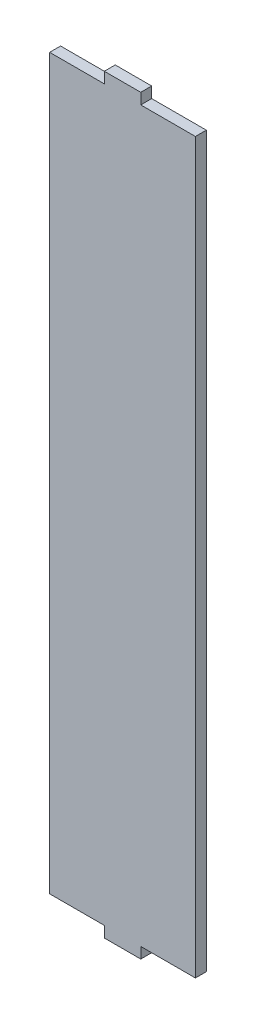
from build123d import *

# Parameters (mm, degrees)
BOSS_EXTRUDE1_DEPTH = 3


with BuildPart() as part:
    # Sketch1 → Boss-Extrude1 (new body)
    with BuildSketch(Plane.XY):
        Polygon((-33.461538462, 190.782900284), (-18.461538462, 190.782900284), (-18.461538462, 193.782900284), (-8.461538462, 193.782900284), (-8.461538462, 190.782900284), (6.538461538, 190.782900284), (6.538461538, -9.217099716), (-8.461538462, -9.217099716), (-8.461538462, -12.217099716), (-18.461538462, -12.217099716), (-18.461538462, -9.217099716), (-33.461538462, -9.217099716), align=None)
    extrude(amount=BOSS_EXTRUDE1_DEPTH)


solid = part.part
